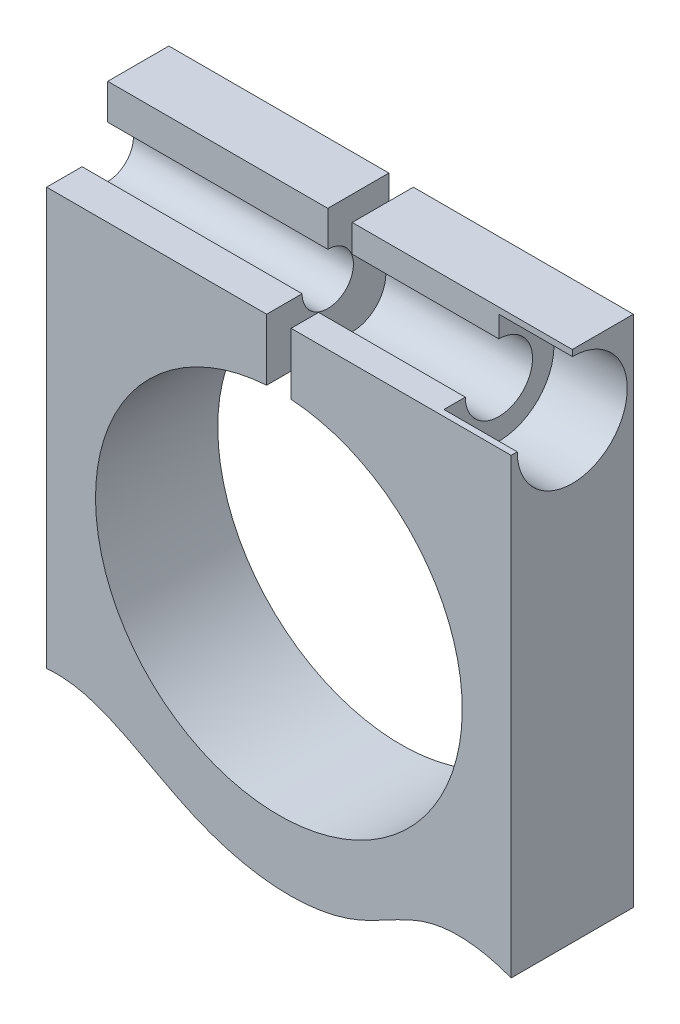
ISO-10303-21;
HEADER;
FILE_DESCRIPTION(('STEP AP214'),'2;1');
FILE_NAME('part.step','',(''),(''),'','','');
FILE_SCHEMA(('AUTOMOTIVE_DESIGN { 1 0 10303 214 1 1 1 1 }'));
ENDSEC;
DATA;
#1=APPLICATION_CONTEXT('core data for automotive mechanical design processes');
#2=APPLICATION_PROTOCOL_DEFINITION('international standard','automotive_design',2000,#1);
#3=PRODUCT_CONTEXT('',#1,'mechanical');
#4=PRODUCT('Part','Part','',(#3));
#5=PRODUCT_RELATED_PRODUCT_CATEGORY('part','',(#4));
#6=PRODUCT_DEFINITION_FORMATION('','',#4);
#7=PRODUCT_DEFINITION_CONTEXT('part definition',#1,'design');
#8=PRODUCT_DEFINITION('design','',#6,#7);
#9=PRODUCT_DEFINITION_SHAPE('','',#8);
#10=(LENGTH_UNIT() NAMED_UNIT(*) SI_UNIT(.MILLI.,.METRE.));
#11=(NAMED_UNIT(*) PLANE_ANGLE_UNIT() SI_UNIT($,.RADIAN.));
#12=(NAMED_UNIT(*) SI_UNIT($,.STERADIAN.) SOLID_ANGLE_UNIT());
#13=UNCERTAINTY_MEASURE_WITH_UNIT(LENGTH_MEASURE(1.E-05),#10,'distance_accuracy_value','');
#14=(GEOMETRIC_REPRESENTATION_CONTEXT(3) GLOBAL_UNCERTAINTY_ASSIGNED_CONTEXT((#13)) GLOBAL_UNIT_ASSIGNED_CONTEXT((#10,
#11,#12)) REPRESENTATION_CONTEXT('',''));
#15=CARTESIAN_POINT('',(0.,0.,0.));
#16=DIRECTION('',(0.,0.,1.));
#17=DIRECTION('',(1.,0.,0.));
#18=AXIS2_PLACEMENT_3D('',#15,#16,#17);
#19=CARTESIAN_POINT('',(-19.,25.,10.));
#20=DIRECTION('',(1.,0.,0.));
#21=DIRECTION('',(0.,1.,0.));
#22=AXIS2_PLACEMENT_3D('',#19,#20,#21);
#23=PLANE('',#22);
#24=DIRECTION('',(0.,-1.,0.));
#25=VECTOR('',#24,1.);
#26=CARTESIAN_POINT('',(-19.,25.,0.));
#27=LINE('',#26,#25);
#28=CARTESIAN_POINT('',(-19.,25.,0.));
#29=VERTEX_POINT('',#28);
#30=CARTESIAN_POINT('',(-19.,-14.1013051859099,0.));
#31=VERTEX_POINT('',#30);
#32=EDGE_CURVE('E167',#29,#31,#27,.T.);
#33=ORIENTED_EDGE('',*,*,#32,.T.);
#34=DIRECTION('',(0.,0.,1.));
#35=VECTOR('',#34,1.);
#36=CARTESIAN_POINT('',(-19.,-14.101305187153,0.));
#37=LINE('',#36,#35);
#38=CARTESIAN_POINT('',(-18.9999999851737,-14.10130518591,10.));
#39=VERTEX_POINT('',#38);
#40=EDGE_CURVE('E47',#31,#39,#37,.T.);
#41=ORIENTED_EDGE('',*,*,#40,.T.);
#42=DIRECTION('',(0.,-1.,0.));
#43=VECTOR('',#42,1.);
#44=CARTESIAN_POINT('',(-19.,25.,10.));
#45=LINE('',#44,#43);
#46=CARTESIAN_POINT('',(-19.,20.,10.));
#47=VERTEX_POINT('',#46);
#48=EDGE_CURVE('E184',#47,#39,#45,.T.);
#49=ORIENTED_EDGE('',*,*,#48,.F.);
#50=DIRECTION('',(0.,0.,-1.));
#51=VECTOR('',#50,1.);
#52=CARTESIAN_POINT('',(-19.,20.,10.));
#53=LINE('',#52,#51);
#54=CARTESIAN_POINT('',(-19.,20.,7.09999999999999));
#55=VERTEX_POINT('',#54);
#56=EDGE_CURVE('E266',#47,#55,#53,.T.);
#57=ORIENTED_EDGE('',*,*,#56,.T.);
#58=CARTESIAN_POINT('',(-19.,20.,5.));
#59=DIRECTION('',(1.,0.,0.));
#60=DIRECTION('',(0.,0.,-1.));
#61=AXIS2_PLACEMENT_3D('',#58,#59,#60);
#62=CIRCLE('',#61,2.1);
#63=CARTESIAN_POINT('',(-19.,22.1,5.));
#64=VERTEX_POINT('',#63);
#65=EDGE_CURVE('E240',#55,#64,#62,.T.);
#66=ORIENTED_EDGE('',*,*,#65,.T.);
#67=DIRECTION('',(0.,1.,0.));
#68=VECTOR('',#67,1.);
#69=CARTESIAN_POINT('',(-19.,25.,5.));
#70=LINE('',#69,#68);
#71=CARTESIAN_POINT('',(-19.,25.,5.));
#72=VERTEX_POINT('',#71);
#73=EDGE_CURVE('E227',#64,#72,#70,.T.);
#74=ORIENTED_EDGE('',*,*,#73,.T.);
#75=DIRECTION('',(0.,0.,-1.));
#76=VECTOR('',#75,1.);
#77=CARTESIAN_POINT('',(-19.,25.,10.));
#78=LINE('',#77,#76);
#79=EDGE_CURVE('E195',#72,#29,#78,.T.);
#80=ORIENTED_EDGE('',*,*,#79,.T.);
#81=EDGE_LOOP('',(#33,#41,#49,#57,#66,#74,#80));
#82=FACE_BOUND('',#81,.T.);
#83=ADVANCED_FACE('F33',(#82),#23,.F.);
#84=CARTESIAN_POINT('',(19.,25.,10.));
#85=DIRECTION('',(-1.,0.,0.));
#86=DIRECTION('',(0.,-1.,0.));
#87=AXIS2_PLACEMENT_3D('',#84,#85,#86);
#88=PLANE('',#87);
#89=DIRECTION('',(0.,1.,0.));
#90=VECTOR('',#89,1.);
#91=CARTESIAN_POINT('',(19.,25.,10.));
#92=LINE('',#91,#90);
#93=CARTESIAN_POINT('',(19.0000000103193,-17.0263321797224,10.));
#94=VERTEX_POINT('',#93);
#95=CARTESIAN_POINT('',(19.,20.,10.));
#96=VERTEX_POINT('',#95);
#97=EDGE_CURVE('E160',#94,#96,#92,.T.);
#98=ORIENTED_EDGE('',*,*,#97,.F.);
#99=DIRECTION('',(0.,0.,1.));
#100=VECTOR('',#99,1.);
#101=CARTESIAN_POINT('',(19.,-17.0263321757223,0.));
#102=LINE('',#101,#100);
#103=CARTESIAN_POINT('',(19.0000000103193,-17.0263321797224,0.));
#104=VERTEX_POINT('',#103);
#105=EDGE_CURVE('E145',#94,#104,#102,.F.);
#106=ORIENTED_EDGE('',*,*,#105,.T.);
#107=DIRECTION('',(0.,1.,0.));
#108=VECTOR('',#107,1.);
#109=CARTESIAN_POINT('',(19.,25.,0.));
#110=LINE('',#109,#108);
#111=CARTESIAN_POINT('',(19.,25.,0.));
#112=VERTEX_POINT('',#111);
#113=EDGE_CURVE('E157',#104,#112,#110,.T.);
#114=ORIENTED_EDGE('',*,*,#113,.T.);
#115=DIRECTION('',(0.,0.,-1.));
#116=VECTOR('',#115,1.);
#117=CARTESIAN_POINT('',(19.,25.,10.));
#118=LINE('',#117,#116);
#119=CARTESIAN_POINT('',(19.,25.,5.));
#120=VERTEX_POINT('',#119);
#121=EDGE_CURVE('E207',#120,#112,#118,.T.);
#122=ORIENTED_EDGE('',*,*,#121,.F.);
#123=DIRECTION('',(0.,1.,0.));
#124=VECTOR('',#123,1.);
#125=CARTESIAN_POINT('',(19.,25.,5.));
#126=LINE('',#125,#124);
#127=CARTESIAN_POINT('',(19.,24.5,5.));
#128=VERTEX_POINT('',#127);
#129=EDGE_CURVE('E282',#128,#120,#126,.T.);
#130=ORIENTED_EDGE('',*,*,#129,.F.);
#131=CARTESIAN_POINT('',(19.,20.,5.));
#132=DIRECTION('',(1.,0.,0.));
#133=DIRECTION('',(0.,1.,0.));
#134=AXIS2_PLACEMENT_3D('',#131,#132,#133);
#135=CIRCLE('',#134,4.5);
#136=CARTESIAN_POINT('',(19.,20.,9.5));
#137=VERTEX_POINT('',#136);
#138=EDGE_CURVE('E229',#137,#128,#135,.T.);
#139=ORIENTED_EDGE('',*,*,#138,.F.);
#140=DIRECTION('',(0.,0.,-1.));
#141=VECTOR('',#140,1.);
#142=CARTESIAN_POINT('',(19.,20.,10.));
#143=LINE('',#142,#141);
#144=EDGE_CURVE('E287',#96,#137,#143,.T.);
#145=ORIENTED_EDGE('',*,*,#144,.F.);
#146=EDGE_LOOP('',(#98,#106,#114,#122,#130,#139,#145));
#147=FACE_BOUND('',#146,.T.);
#148=ADVANCED_FACE('F155',(#147),#88,.F.);
#149=CARTESIAN_POINT('',(0.999999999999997,25.,10.));
#150=DIRECTION('',(0.,-1.,0.));
#151=DIRECTION('',(0.,0.,-1.));
#152=AXIS2_PLACEMENT_3D('',#149,#150,#151);
#153=PLANE('',#152);
#154=DIRECTION('',(0.,0.,-1.));
#155=VECTOR('',#154,1.);
#156=CARTESIAN_POINT('',(0.999999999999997,25.,10.));
#157=LINE('',#156,#155);
#158=CARTESIAN_POINT('',(0.999999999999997,25.,5.));
#159=VERTEX_POINT('',#158);
#160=CARTESIAN_POINT('',(0.999999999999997,25.,0.));
#161=VERTEX_POINT('',#160);
#162=EDGE_CURVE('E205',#159,#161,#157,.T.);
#163=ORIENTED_EDGE('',*,*,#162,.F.);
#164=DIRECTION('',(1.,0.,0.));
#165=VECTOR('',#164,1.);
#166=CARTESIAN_POINT('',(-26.,25.,5.));
#167=LINE('',#166,#165);
#168=EDGE_CURVE('E283',#159,#120,#167,.T.);
#169=ORIENTED_EDGE('',*,*,#168,.T.);
#170=ORIENTED_EDGE('',*,*,#121,.T.);
#171=DIRECTION('',(-1.,0.,0.));
#172=VECTOR('',#171,1.);
#173=CARTESIAN_POINT('',(0.999999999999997,25.,0.));
#174=LINE('',#173,#172);
#175=EDGE_CURVE('E166',#112,#161,#174,.T.);
#176=ORIENTED_EDGE('',*,*,#175,.T.);
#177=EDGE_LOOP('',(#163,#169,#170,#176));
#178=FACE_BOUND('',#177,.T.);
#179=ADVANCED_FACE('F338',(#178),#153,.F.);
#180=CARTESIAN_POINT('',(0.999999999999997,25.,10.));
#181=DIRECTION('',(1.,0.,0.));
#182=DIRECTION('',(0.,1.,0.));
#183=AXIS2_PLACEMENT_3D('',#180,#181,#182);
#184=PLANE('',#183);
#185=CARTESIAN_POINT('',(0.999999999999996,20.,5.));
#186=DIRECTION('',(1.,0.,0.));
#187=DIRECTION('',(0.,1.,0.));
#188=AXIS2_PLACEMENT_3D('',#185,#186,#187);
#189=CIRCLE('',#188,2.75);
#190=CARTESIAN_POINT('',(0.999999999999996,20.,7.75));
#191=VERTEX_POINT('',#190);
#192=CARTESIAN_POINT('',(0.999999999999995,22.75,5.));
#193=VERTEX_POINT('',#192);
#194=EDGE_CURVE('E216',#191,#193,#189,.T.);
#195=ORIENTED_EDGE('',*,*,#194,.T.);
#196=DIRECTION('',(0.,1.,0.));
#197=VECTOR('',#196,1.);
#198=CARTESIAN_POINT('',(0.999999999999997,25.,5.));
#199=LINE('',#198,#197);
#200=EDGE_CURVE('E257',#193,#159,#199,.T.);
#201=ORIENTED_EDGE('',*,*,#200,.T.);
#202=ORIENTED_EDGE('',*,*,#162,.T.);
#203=DIRECTION('',(0.,-1.,0.));
#204=VECTOR('',#203,1.);
#205=CARTESIAN_POINT('',(0.999999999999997,25.,0.));
#206=LINE('',#205,#204);
#207=CARTESIAN_POINT('',(0.999999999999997,14.9666295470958,0.));
#208=VERTEX_POINT('',#207);
#209=EDGE_CURVE('E169',#161,#208,#206,.T.);
#210=ORIENTED_EDGE('',*,*,#209,.T.);
#211=DIRECTION('',(0.,0.,-1.));
#212=VECTOR('',#211,1.);
#213=CARTESIAN_POINT('',(0.999999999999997,14.9666295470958,10.));
#214=LINE('',#213,#212);
#215=CARTESIAN_POINT('',(0.999999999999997,14.9666295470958,10.));
#216=VERTEX_POINT('',#215);
#217=EDGE_CURVE('E202',#216,#208,#214,.T.);
#218=ORIENTED_EDGE('',*,*,#217,.F.);
#219=DIRECTION('',(0.,-1.,0.));
#220=VECTOR('',#219,1.);
#221=CARTESIAN_POINT('',(0.999999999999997,25.,10.));
#222=LINE('',#221,#220);
#223=CARTESIAN_POINT('',(0.999999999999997,20.,10.));
#224=VERTEX_POINT('',#223);
#225=EDGE_CURVE('E188',#224,#216,#222,.T.);
#226=ORIENTED_EDGE('',*,*,#225,.F.);
#227=DIRECTION('',(0.,0.,-1.));
#228=VECTOR('',#227,1.);
#229=CARTESIAN_POINT('',(0.999999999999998,20.,10.));
#230=LINE('',#229,#228);
#231=EDGE_CURVE('E271',#224,#191,#230,.T.);
#232=ORIENTED_EDGE('',*,*,#231,.T.);
#233=EDGE_LOOP('',(#195,#201,#202,#210,#218,#226,#232));
#234=FACE_BOUND('',#233,.T.);
#235=ADVANCED_FACE('F334',(#234),#184,.F.);
#236=CARTESIAN_POINT('',(0.,0.,10.));
#237=DIRECTION('',(0.,0.,-1.));
#238=DIRECTION('',(-1.,0.,0.));
#239=AXIS2_PLACEMENT_3D('',#236,#237,#238);
#240=CYLINDRICAL_SURFACE('',#239,15.);
#241=CARTESIAN_POINT('',(0.,0.,0.));
#242=DIRECTION('',(0.,0.,-1.));
#243=DIRECTION('',(1.,0.,0.));
#244=AXIS2_PLACEMENT_3D('',#241,#242,#243);
#245=CIRCLE('',#244,15.);
#246=CARTESIAN_POINT('',(-1.,14.9666295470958,0.));
#247=VERTEX_POINT('',#246);
#248=EDGE_CURVE('E176',#208,#247,#245,.T.);
#249=ORIENTED_EDGE('',*,*,#248,.T.);
#250=DIRECTION('',(0.,0.,-1.));
#251=VECTOR('',#250,1.);
#252=CARTESIAN_POINT('',(-1.,14.9666295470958,10.));
#253=LINE('',#252,#251);
#254=CARTESIAN_POINT('',(-1.,14.9666295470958,10.));
#255=VERTEX_POINT('',#254);
#256=EDGE_CURVE('E199',#255,#247,#253,.T.);
#257=ORIENTED_EDGE('',*,*,#256,.F.);
#258=CARTESIAN_POINT('',(0.,0.,10.));
#259=DIRECTION('',(0.,0.,-1.));
#260=DIRECTION('',(1.,0.,0.));
#261=AXIS2_PLACEMENT_3D('',#258,#259,#260);
#262=CIRCLE('',#261,15.);
#263=EDGE_CURVE('E190',#216,#255,#262,.T.);
#264=ORIENTED_EDGE('',*,*,#263,.F.);
#265=ORIENTED_EDGE('',*,*,#217,.T.);
#266=EDGE_LOOP('',(#249,#257,#264,#265));
#267=FACE_BOUND('',#266,.T.);
#268=ADVANCED_FACE('F331',(#267),#240,.F.);
#269=CARTESIAN_POINT('',(-1.,25.,10.));
#270=DIRECTION('',(-1.,0.,0.));
#271=DIRECTION('',(0.,-1.,0.));
#272=AXIS2_PLACEMENT_3D('',#269,#270,#271);
#273=PLANE('',#272);
#274=DIRECTION('',(0.,0.,-1.));
#275=VECTOR('',#274,1.);
#276=CARTESIAN_POINT('',(-1.,25.,10.));
#277=LINE('',#276,#275);
#278=CARTESIAN_POINT('',(-1.,25.,5.));
#279=VERTEX_POINT('',#278);
#280=CARTESIAN_POINT('',(-1.,25.,0.));
#281=VERTEX_POINT('',#280);
#282=EDGE_CURVE('E197',#279,#281,#277,.T.);
#283=ORIENTED_EDGE('',*,*,#282,.F.);
#284=DIRECTION('',(0.,-1.,0.));
#285=VECTOR('',#284,1.);
#286=CARTESIAN_POINT('',(-1.,25.,5.));
#287=LINE('',#286,#285);
#288=CARTESIAN_POINT('',(-1.,22.1,5.));
#289=VERTEX_POINT('',#288);
#290=EDGE_CURVE('E232',#279,#289,#287,.T.);
#291=ORIENTED_EDGE('',*,*,#290,.T.);
#292=CARTESIAN_POINT('',(-1.,20.,5.));
#293=DIRECTION('',(1.,0.,0.));
#294=DIRECTION('',(0.,0.,-1.));
#295=AXIS2_PLACEMENT_3D('',#292,#293,#294);
#296=CIRCLE('',#295,2.09999999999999);
#297=CARTESIAN_POINT('',(-1.,20.,7.09999999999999));
#298=VERTEX_POINT('',#297);
#299=EDGE_CURVE('E171',#298,#289,#296,.T.);
#300=ORIENTED_EDGE('',*,*,#299,.F.);
#301=DIRECTION('',(0.,0.,1.));
#302=VECTOR('',#301,1.);
#303=CARTESIAN_POINT('',(-1.,20.,10.));
#304=LINE('',#303,#302);
#305=CARTESIAN_POINT('',(-1.,20.,10.));
#306=VERTEX_POINT('',#305);
#307=EDGE_CURVE('E55',#298,#306,#304,.T.);
#308=ORIENTED_EDGE('',*,*,#307,.T.);
#309=DIRECTION('',(0.,1.,0.));
#310=VECTOR('',#309,1.);
#311=CARTESIAN_POINT('',(-1.,25.,10.));
#312=LINE('',#311,#310);
#313=EDGE_CURVE('E192',#255,#306,#312,.T.);
#314=ORIENTED_EDGE('',*,*,#313,.F.);
#315=ORIENTED_EDGE('',*,*,#256,.T.);
#316=DIRECTION('',(0.,1.,0.));
#317=VECTOR('',#316,1.);
#318=CARTESIAN_POINT('',(-1.,25.,0.));
#319=LINE('',#318,#317);
#320=EDGE_CURVE('E178',#247,#281,#319,.T.);
#321=ORIENTED_EDGE('',*,*,#320,.T.);
#322=EDGE_LOOP('',(#283,#291,#300,#308,#314,#315,#321));
#323=FACE_BOUND('',#322,.T.);
#324=ADVANCED_FACE('F253',(#323),#273,.F.);
#325=CARTESIAN_POINT('',(-19.,25.,10.));
#326=DIRECTION('',(0.,-1.,0.));
#327=DIRECTION('',(0.,0.,-1.));
#328=AXIS2_PLACEMENT_3D('',#325,#326,#327);
#329=PLANE('',#328);
#330=ORIENTED_EDGE('',*,*,#79,.F.);
#331=EDGE_CURVE('E277',#72,#279,#167,.T.);
#332=ORIENTED_EDGE('',*,*,#331,.T.);
#333=ORIENTED_EDGE('',*,*,#282,.T.);
#334=DIRECTION('',(-1.,0.,0.));
#335=VECTOR('',#334,1.);
#336=CARTESIAN_POINT('',(-19.,25.,0.));
#337=LINE('',#336,#335);
#338=EDGE_CURVE('E181',#281,#29,#337,.T.);
#339=ORIENTED_EDGE('',*,*,#338,.T.);
#340=EDGE_LOOP('',(#330,#332,#333,#339));
#341=FACE_BOUND('',#340,.T.);
#342=ADVANCED_FACE('F324',(#341),#329,.F.);
#343=CARTESIAN_POINT('',(0.,0.,10.));
#344=DIRECTION('',(0.,0.,1.));
#345=DIRECTION('',(1.,0.,0.));
#346=AXIS2_PLACEMENT_3D('',#343,#344,#345);
#347=PLANE('',#346);
#348=CARTESIAN_POINT('',(-32.750084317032,-22.352107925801,10.));
#349=CARTESIAN_POINT('',(-39.4126137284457,-28.8152972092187,10.));
#350=CARTESIAN_POINT('',(-54.2972679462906,-49.0451056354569,10.));
#351=CARTESIAN_POINT('',(-10.0048837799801,-62.0691248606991,10.));
#352=CARTESIAN_POINT('',(27.0022909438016,-58.7448603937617,10.));
#353=CARTESIAN_POINT('',(31.6084265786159,-20.7249990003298,10.));
#354=CARTESIAN_POINT('',(13.3896338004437,-14.7140111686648,10.));
#355=CARTESIAN_POINT('',(4.83572235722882,-21.026723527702,10.));
#356=CARTESIAN_POINT('',(-6.33343154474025,-20.1158192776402,10.));
#357=CARTESIAN_POINT('',(-18.5699894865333,-10.7385529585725,10.));
#358=CARTESIAN_POINT('',(-27.6475174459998,-17.4022077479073,10.));
#359=CARTESIAN_POINT('',(-32.750084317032,-22.352107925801,10.));
#360=B_SPLINE_CURVE_WITH_KNOTS('',3,(#348,#349,#350,#351,#352,#353,#354,#355,#356,#357,#358,
#359),.UNSPECIFIED.,.T.,.F.,(4,1,1,1,1,1,1,1,1,4),(0.,0.126499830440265,0.324616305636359,
0.5177086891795,0.679576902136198,0.738924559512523,0.773774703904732,0.843187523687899,
0.903118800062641,1.),.UNSPECIFIED.);
#361=EDGE_CURVE('E151',#94,#39,#360,.T.);
#362=ORIENTED_EDGE('',*,*,#361,.F.);
#363=ORIENTED_EDGE('',*,*,#97,.T.);
#364=DIRECTION('',(1.,0.,0.));
#365=VECTOR('',#364,1.);
#366=CARTESIAN_POINT('',(-26.,20.,10.));
#367=LINE('',#366,#365);
#368=EDGE_CURVE('E278',#224,#96,#367,.T.);
#369=ORIENTED_EDGE('',*,*,#368,.F.);
#370=ORIENTED_EDGE('',*,*,#225,.T.);
#371=ORIENTED_EDGE('',*,*,#263,.T.);
#372=ORIENTED_EDGE('',*,*,#313,.T.);
#373=EDGE_CURVE('E281',#47,#306,#367,.T.);
#374=ORIENTED_EDGE('',*,*,#373,.F.);
#375=ORIENTED_EDGE('',*,*,#48,.T.);
#376=EDGE_LOOP('',(#362,#363,#369,#370,#371,#372,#374,#375));
#377=FACE_BOUND('',#376,.T.);
#378=ADVANCED_FACE('F321',(#377),#347,.T.);
#379=CARTESIAN_POINT('',(0.,0.,0.));
#380=DIRECTION('',(0.,0.,1.));
#381=DIRECTION('',(1.,0.,0.));
#382=AXIS2_PLACEMENT_3D('',#379,#380,#381);
#383=PLANE('',#382);
#384=ORIENTED_EDGE('',*,*,#113,.F.);
#385=CARTESIAN_POINT('',(-32.750084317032,-22.352107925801,0.));
#386=CARTESIAN_POINT('',(-39.4126137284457,-28.8152972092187,0.));
#387=CARTESIAN_POINT('',(-54.2972679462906,-49.0451056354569,0.));
#388=CARTESIAN_POINT('',(-10.0048837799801,-62.0691248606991,0.));
#389=CARTESIAN_POINT('',(27.0022909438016,-58.7448603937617,0.));
#390=CARTESIAN_POINT('',(31.6084265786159,-20.7249990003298,0.));
#391=CARTESIAN_POINT('',(13.3896338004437,-14.7140111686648,0.));
#392=CARTESIAN_POINT('',(4.83572235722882,-21.026723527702,0.));
#393=CARTESIAN_POINT('',(-6.33343154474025,-20.1158192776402,0.));
#394=CARTESIAN_POINT('',(-18.5699894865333,-10.7385529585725,0.));
#395=CARTESIAN_POINT('',(-27.6475174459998,-17.4022077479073,0.));
#396=CARTESIAN_POINT('',(-32.750084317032,-22.352107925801,0.));
#397=B_SPLINE_CURVE_WITH_KNOTS('',3,(#385,#386,#387,#388,#389,#390,#391,#392,#393,#394,#395,
#396),.UNSPECIFIED.,.T.,.F.,(4,1,1,1,1,1,1,1,1,4),(0.,0.126499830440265,0.324616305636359,
0.5177086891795,0.679576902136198,0.738924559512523,0.773774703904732,0.843187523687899,
0.903118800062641,1.),.UNSPECIFIED.);
#398=EDGE_CURVE('E142',#104,#31,#397,.T.);
#399=ORIENTED_EDGE('',*,*,#398,.T.);
#400=ORIENTED_EDGE('',*,*,#32,.F.);
#401=ORIENTED_EDGE('',*,*,#338,.F.);
#402=ORIENTED_EDGE('',*,*,#320,.F.);
#403=ORIENTED_EDGE('',*,*,#248,.F.);
#404=ORIENTED_EDGE('',*,*,#209,.F.);
#405=ORIENTED_EDGE('',*,*,#175,.F.);
#406=EDGE_LOOP('',(#384,#399,#400,#401,#402,#403,#404,#405));
#407=FACE_BOUND('',#406,.T.);
#408=ADVANCED_FACE('F163',(#407),#383,.F.);
#409=CARTESIAN_POINT('',(-1.,20.,5.));
#410=DIRECTION('',(1.,0.,0.));
#411=DIRECTION('',(0.,0.,-1.));
#412=AXIS2_PLACEMENT_3D('',#409,#410,#411);
#413=CYLINDRICAL_SURFACE('',#412,2.09999999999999);
#414=ORIENTED_EDGE('',*,*,#299,.T.);
#415=DIRECTION('',(1.,0.,0.));
#416=VECTOR('',#415,1.);
#417=CARTESIAN_POINT('',(-1.,22.1,5.));
#418=LINE('',#417,#416);
#419=EDGE_CURVE('E248',#289,#64,#418,.F.);
#420=ORIENTED_EDGE('',*,*,#419,.T.);
#421=ORIENTED_EDGE('',*,*,#65,.F.);
#422=DIRECTION('',(1.,0.,0.));
#423=VECTOR('',#422,1.);
#424=CARTESIAN_POINT('',(-1.,20.,7.09999999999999));
#425=LINE('',#424,#423);
#426=EDGE_CURVE('E249',#55,#298,#425,.T.);
#427=ORIENTED_EDGE('',*,*,#426,.T.);
#428=EDGE_LOOP('',(#414,#420,#421,#427));
#429=FACE_BOUND('',#428,.T.);
#430=ADVANCED_FACE('F246',(#429),#413,.F.);
#431=CARTESIAN_POINT('',(13.,20.,5.));
#432=DIRECTION('',(1.,0.,0.));
#433=DIRECTION('',(0.,1.,0.));
#434=AXIS2_PLACEMENT_3D('',#431,#432,#433);
#435=CYLINDRICAL_SURFACE('',#434,4.5);
#436=ORIENTED_EDGE('',*,*,#138,.T.);
#437=DIRECTION('',(1.,0.,0.));
#438=VECTOR('',#437,1.);
#439=CARTESIAN_POINT('',(13.,24.5,5.));
#440=LINE('',#439,#438);
#441=CARTESIAN_POINT('',(13.,24.5,5.));
#442=VERTEX_POINT('',#441);
#443=EDGE_CURVE('E262',#128,#442,#440,.F.);
#444=ORIENTED_EDGE('',*,*,#443,.T.);
#445=CARTESIAN_POINT('',(13.,20.,5.));
#446=DIRECTION('',(1.,0.,0.));
#447=DIRECTION('',(0.,1.,0.));
#448=AXIS2_PLACEMENT_3D('',#445,#446,#447);
#449=CIRCLE('',#448,4.5);
#450=CARTESIAN_POINT('',(13.,20.,9.5));
#451=VERTEX_POINT('',#450);
#452=EDGE_CURVE('E238',#451,#442,#449,.T.);
#453=ORIENTED_EDGE('',*,*,#452,.F.);
#454=DIRECTION('',(1.,0.,0.));
#455=VECTOR('',#454,1.);
#456=CARTESIAN_POINT('',(13.,20.,9.5));
#457=LINE('',#456,#455);
#458=EDGE_CURVE('E273',#451,#137,#457,.T.);
#459=ORIENTED_EDGE('',*,*,#458,.T.);
#460=EDGE_LOOP('',(#436,#444,#453,#459));
#461=FACE_BOUND('',#460,.T.);
#462=ADVANCED_FACE('F313',(#461),#435,.F.);
#463=CARTESIAN_POINT('',(13.,20.,5.));
#464=DIRECTION('',(1.,0.,0.));
#465=DIRECTION('',(0.,1.,0.));
#466=AXIS2_PLACEMENT_3D('',#463,#464,#465);
#467=PLANE('',#466);
#468=DIRECTION('',(0.,1.,0.));
#469=VECTOR('',#468,1.);
#470=CARTESIAN_POINT('',(13.,20.,5.));
#471=LINE('',#470,#469);
#472=CARTESIAN_POINT('',(13.,22.75,5.));
#473=VERTEX_POINT('',#472);
#474=EDGE_CURVE('E226',#473,#442,#471,.T.);
#475=ORIENTED_EDGE('',*,*,#474,.F.);
#476=CARTESIAN_POINT('',(13.,20.,5.));
#477=DIRECTION('',(1.,0.,0.));
#478=DIRECTION('',(0.,1.,0.));
#479=AXIS2_PLACEMENT_3D('',#476,#477,#478);
#480=CIRCLE('',#479,2.75);
#481=CARTESIAN_POINT('',(13.,20.,7.75));
#482=VERTEX_POINT('',#481);
#483=EDGE_CURVE('E214',#482,#473,#480,.T.);
#484=ORIENTED_EDGE('',*,*,#483,.F.);
#485=DIRECTION('',(0.,0.,-1.));
#486=VECTOR('',#485,1.);
#487=CARTESIAN_POINT('',(13.,20.,5.));
#488=LINE('',#487,#486);
#489=EDGE_CURVE('E224',#451,#482,#488,.T.);
#490=ORIENTED_EDGE('',*,*,#489,.F.);
#491=ORIENTED_EDGE('',*,*,#452,.T.);
#492=EDGE_LOOP('',(#475,#484,#490,#491));
#493=FACE_BOUND('',#492,.T.);
#494=ADVANCED_FACE('F222',(#493),#467,.T.);
#495=CARTESIAN_POINT('',(0.999999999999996,20.,5.));
#496=DIRECTION('',(1.,0.,0.));
#497=DIRECTION('',(0.,1.,0.));
#498=AXIS2_PLACEMENT_3D('',#495,#496,#497);
#499=CYLINDRICAL_SURFACE('',#498,2.75);
#500=ORIENTED_EDGE('',*,*,#483,.T.);
#501=DIRECTION('',(1.,0.,0.));
#502=VECTOR('',#501,1.);
#503=CARTESIAN_POINT('',(0.999999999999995,22.75,5.));
#504=LINE('',#503,#502);
#505=EDGE_CURVE('E11',#473,#193,#504,.F.);
#506=ORIENTED_EDGE('',*,*,#505,.T.);
#507=ORIENTED_EDGE('',*,*,#194,.F.);
#508=DIRECTION('',(1.,0.,0.));
#509=VECTOR('',#508,1.);
#510=CARTESIAN_POINT('',(0.999999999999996,20.,7.75));
#511=LINE('',#510,#509);
#512=EDGE_CURVE('E40',#191,#482,#511,.T.);
#513=ORIENTED_EDGE('',*,*,#512,.T.);
#514=EDGE_LOOP('',(#500,#506,#507,#513));
#515=FACE_BOUND('',#514,.T.);
#516=ADVANCED_FACE('F213',(#515),#499,.F.);
#517=CARTESIAN_POINT('',(-26.,20.,10.));
#518=DIRECTION('',(0.,-1.,0.));
#519=DIRECTION('',(1.,0.,0.));
#520=AXIS2_PLACEMENT_3D('',#517,#518,#519);
#521=PLANE('',#520);
#522=ORIENTED_EDGE('',*,*,#368,.T.);
#523=ORIENTED_EDGE('',*,*,#144,.T.);
#524=ORIENTED_EDGE('',*,*,#458,.F.);
#525=ORIENTED_EDGE('',*,*,#489,.T.);
#526=ORIENTED_EDGE('',*,*,#512,.F.);
#527=ORIENTED_EDGE('',*,*,#231,.F.);
#528=EDGE_LOOP('',(#522,#523,#524,#525,#526,#527));
#529=FACE_BOUND('',#528,.T.);
#530=ADVANCED_FACE('F308',(#529),#521,.F.);
#531=CARTESIAN_POINT('',(-26.,25.,5.));
#532=DIRECTION('',(0.,0.,-1.));
#533=DIRECTION('',(-1.,0.,0.));
#534=AXIS2_PLACEMENT_3D('',#531,#532,#533);
#535=PLANE('',#534);
#536=ORIENTED_EDGE('',*,*,#505,.F.);
#537=ORIENTED_EDGE('',*,*,#474,.T.);
#538=ORIENTED_EDGE('',*,*,#443,.F.);
#539=ORIENTED_EDGE('',*,*,#129,.T.);
#540=ORIENTED_EDGE('',*,*,#168,.F.);
#541=ORIENTED_EDGE('',*,*,#200,.F.);
#542=EDGE_LOOP('',(#536,#537,#538,#539,#540,#541));
#543=FACE_BOUND('',#542,.T.);
#544=ADVANCED_FACE('F305',(#543),#535,.F.);
#545=ORIENTED_EDGE('',*,*,#373,.T.);
#546=ORIENTED_EDGE('',*,*,#307,.F.);
#547=ORIENTED_EDGE('',*,*,#426,.F.);
#548=ORIENTED_EDGE('',*,*,#56,.F.);
#549=EDGE_LOOP('',(#545,#546,#547,#548));
#550=FACE_BOUND('',#549,.T.);
#551=ADVANCED_FACE('F304',(#550),#521,.F.);
#552=ORIENTED_EDGE('',*,*,#419,.F.);
#553=ORIENTED_EDGE('',*,*,#290,.F.);
#554=ORIENTED_EDGE('',*,*,#331,.F.);
#555=ORIENTED_EDGE('',*,*,#73,.F.);
#556=EDGE_LOOP('',(#552,#553,#554,#555));
#557=FACE_BOUND('',#556,.T.);
#558=ADVANCED_FACE('F301',(#557),#535,.F.);
#559=DIRECTION('',(0.,0.,1.));
#560=VECTOR('',#559,1.);
#561=SURFACE_OF_LINEAR_EXTRUSION('',#397,#560);
#562=ORIENTED_EDGE('',*,*,#398,.F.);
#563=ORIENTED_EDGE('',*,*,#105,.F.);
#564=ORIENTED_EDGE('',*,*,#361,.T.);
#565=ORIENTED_EDGE('',*,*,#40,.F.);
#566=EDGE_LOOP('',(#562,#563,#564,#565));
#567=FACE_BOUND('',#566,.T.);
#568=ADVANCED_FACE('F144',(#567),#561,.F.);
#569=CLOSED_SHELL('',(#83,#148,#179,#235,#268,#324,#342,#378,#408,#430,#462,#494,#516,#530,#544,
#551,#558,#568));
#570=MANIFOLD_SOLID_BREP('B2',#569);
#571=ADVANCED_BREP_SHAPE_REPRESENTATION('',(#18,#570),#14);
#572=SHAPE_DEFINITION_REPRESENTATION(#9,#571);
ENDSEC;
END-ISO-10303-21;
